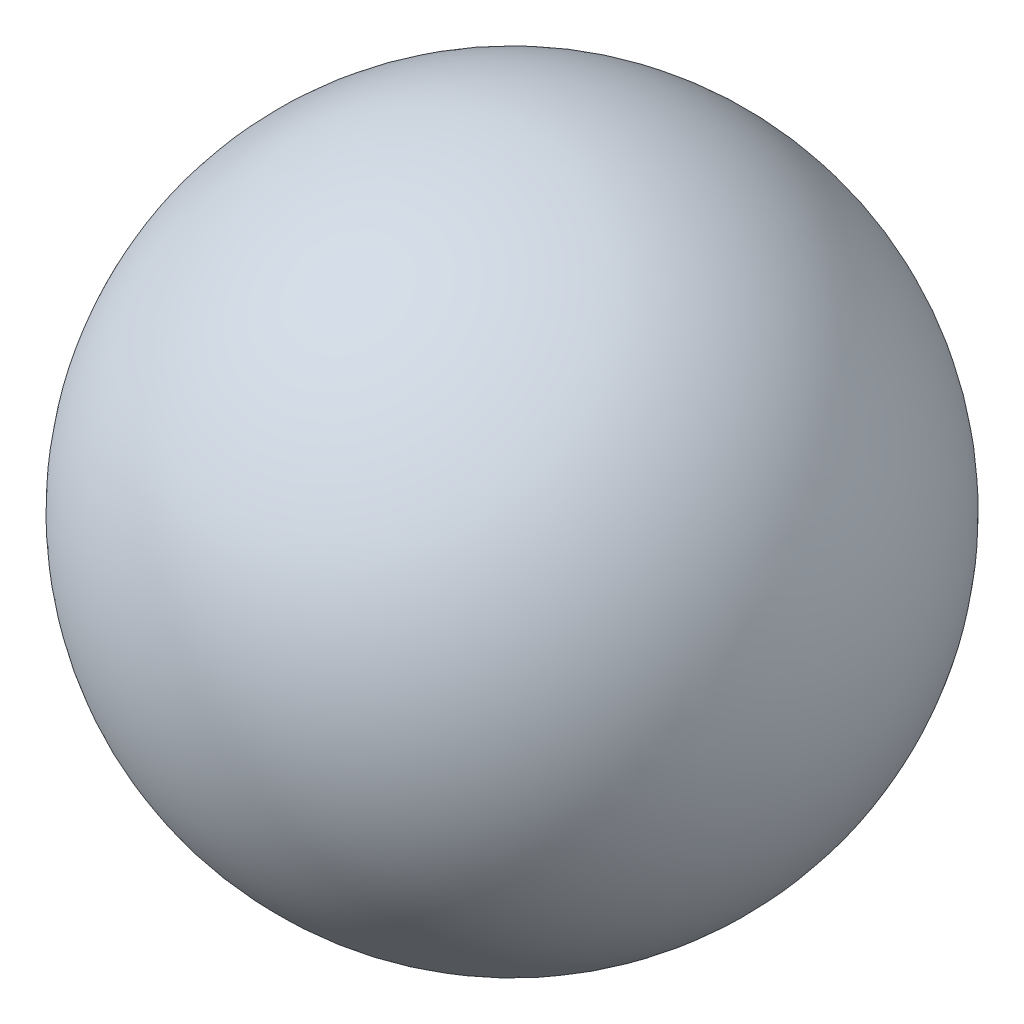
from build123d import *


with BuildPart() as part:
    # Esquisse1 → Base-R_volution (revolve)
    with BuildSketch(Plane(origin=(0, 0, 0), x_dir=(1, 0, 0), z_dir=(0, 1, 0))):
        with BuildLine():
            Line((2.4, 5.2), (9, 5.2))
            ThreePointArc((9, 5.2), (5.7, 8.5), (2.4, 5.2))
        make_face()
    revolve(axis=Axis((-0.3, 0, -5.2), (1, 0, 0)))


solid = part.part
